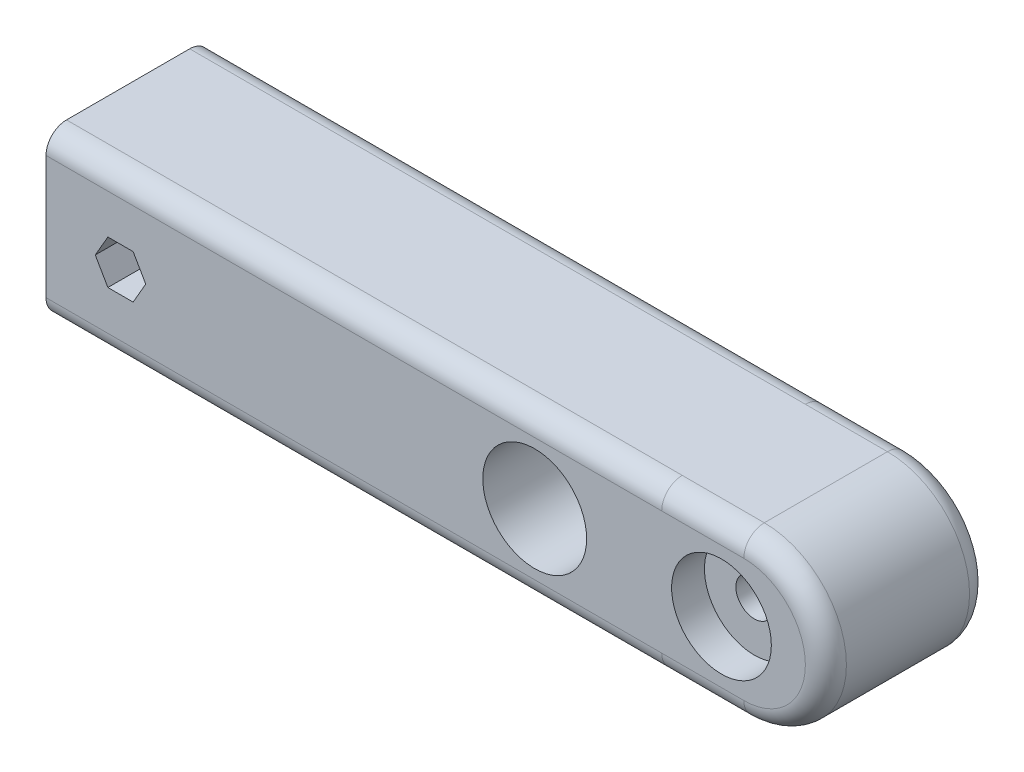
ISO-10303-21;
HEADER;
FILE_DESCRIPTION(('STEP AP214'),'2;1');
FILE_NAME('part.step','',(''),(''),'','','');
FILE_SCHEMA(('AUTOMOTIVE_DESIGN { 1 0 10303 214 1 1 1 1 }'));
ENDSEC;
DATA;
#1=APPLICATION_CONTEXT('core data for automotive mechanical design processes');
#2=APPLICATION_PROTOCOL_DEFINITION('international standard','automotive_design',2000,#1);
#3=PRODUCT_CONTEXT('',#1,'mechanical');
#4=PRODUCT('Part','Part','',(#3));
#5=PRODUCT_RELATED_PRODUCT_CATEGORY('part','',(#4));
#6=PRODUCT_DEFINITION_FORMATION('','',#4);
#7=PRODUCT_DEFINITION_CONTEXT('part definition',#1,'design');
#8=PRODUCT_DEFINITION('design','',#6,#7);
#9=PRODUCT_DEFINITION_SHAPE('','',#8);
#10=(LENGTH_UNIT() NAMED_UNIT(*) SI_UNIT(.MILLI.,.METRE.));
#11=(NAMED_UNIT(*) PLANE_ANGLE_UNIT() SI_UNIT($,.RADIAN.));
#12=(NAMED_UNIT(*) SI_UNIT($,.STERADIAN.) SOLID_ANGLE_UNIT());
#13=UNCERTAINTY_MEASURE_WITH_UNIT(LENGTH_MEASURE(1.E-05),#10,'distance_accuracy_value','');
#14=(GEOMETRIC_REPRESENTATION_CONTEXT(3) GLOBAL_UNCERTAINTY_ASSIGNED_CONTEXT((#13)) GLOBAL_UNIT_ASSIGNED_CONTEXT((#10,
#11,#12)) REPRESENTATION_CONTEXT('',''));
#15=CARTESIAN_POINT('',(0.,0.,0.));
#16=DIRECTION('',(0.,0.,1.));
#17=DIRECTION('',(1.,0.,0.));
#18=AXIS2_PLACEMENT_3D('',#15,#16,#17);
#19=CARTESIAN_POINT('',(21.225,14.6739437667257,86.));
#20=DIRECTION('',(0.,-1.,0.));
#21=DIRECTION('',(1.,0.,0.));
#22=AXIS2_PLACEMENT_3D('',#19,#20,#21);
#23=PLANE('',#22);
#24=DIRECTION('',(1.,0.,0.));
#25=VECTOR('',#24,1.);
#26=CARTESIAN_POINT('',(21.225,14.6739437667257,8.00000000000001));
#27=LINE('',#26,#25);
#28=CARTESIAN_POINT('',(15.075,14.6739437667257,8.00000000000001));
#29=VERTEX_POINT('',#28);
#30=CARTESIAN_POINT('',(21.225,14.6739437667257,8.00000000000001));
#31=VERTEX_POINT('',#30);
#32=EDGE_CURVE('E171',#29,#31,#27,.T.);
#33=ORIENTED_EDGE('',*,*,#32,.F.);
#34=DIRECTION('',(0.,0.,-1.));
#35=VECTOR('',#34,1.);
#36=CARTESIAN_POINT('',(15.075,14.6739437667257,86.));
#37=LINE('',#36,#35);
#38=CARTESIAN_POINT('',(15.075,14.6739437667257,40.));
#39=VERTEX_POINT('',#38);
#40=EDGE_CURVE('E179',#39,#29,#37,.T.);
#41=ORIENTED_EDGE('',*,*,#40,.F.);
#42=DIRECTION('',(-1.,0.,0.));
#43=VECTOR('',#42,1.);
#44=CARTESIAN_POINT('',(0.,14.6739437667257,40.));
#45=LINE('',#44,#43);
#46=CARTESIAN_POINT('',(21.225,14.6739437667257,40.));
#47=VERTEX_POINT('',#46);
#48=EDGE_CURVE('E221',#47,#39,#45,.T.);
#49=ORIENTED_EDGE('',*,*,#48,.F.);
#50=DIRECTION('',(0.,0.,-1.));
#51=VECTOR('',#50,1.);
#52=CARTESIAN_POINT('',(21.225,14.6739437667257,86.));
#53=LINE('',#52,#51);
#54=EDGE_CURVE('E182',#47,#31,#53,.T.);
#55=ORIENTED_EDGE('',*,*,#54,.T.);
#56=EDGE_LOOP('',(#33,#41,#49,#55));
#57=FACE_BOUND('',#56,.T.);
#58=ADVANCED_FACE('F47',(#57),#23,.F.);
#59=CARTESIAN_POINT('',(24.3,20.,86.));
#60=DIRECTION('',(0.866025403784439,-0.5,0.));
#61=DIRECTION('',(0.5,0.866025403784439,0.));
#62=AXIS2_PLACEMENT_3D('',#59,#60,#61);
#63=PLANE('',#62);
#64=DIRECTION('',(0.5,0.866025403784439,0.));
#65=VECTOR('',#64,1.);
#66=CARTESIAN_POINT('',(24.3,20.,8.00000000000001));
#67=LINE('',#66,#65);
#68=CARTESIAN_POINT('',(24.3,20.,8.00000000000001));
#69=VERTEX_POINT('',#68);
#70=EDGE_CURVE('E185',#31,#69,#67,.T.);
#71=ORIENTED_EDGE('',*,*,#70,.F.);
#72=ORIENTED_EDGE('',*,*,#54,.F.);
#73=DIRECTION('',(-0.5,-0.866025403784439,0.));
#74=VECTOR('',#73,1.);
#75=CARTESIAN_POINT('',(26.8852540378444,24.4777913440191,40.));
#76=LINE('',#75,#74);
#77=CARTESIAN_POINT('',(24.3,20.,40.));
#78=VERTEX_POINT('',#77);
#79=EDGE_CURVE('E217',#78,#47,#76,.T.);
#80=ORIENTED_EDGE('',*,*,#79,.F.);
#81=DIRECTION('',(0.,0.,-1.));
#82=VECTOR('',#81,1.);
#83=CARTESIAN_POINT('',(24.3,20.,86.));
#84=LINE('',#83,#82);
#85=EDGE_CURVE('E385',#78,#69,#84,.T.);
#86=ORIENTED_EDGE('',*,*,#85,.T.);
#87=EDGE_LOOP('',(#71,#72,#80,#86));
#88=FACE_BOUND('',#87,.T.);
#89=ADVANCED_FACE('F407',(#88),#63,.F.);
#90=CARTESIAN_POINT('',(21.225,25.3260562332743,86.));
#91=DIRECTION('',(0.866025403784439,0.5,0.));
#92=DIRECTION('',(-0.5,0.866025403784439,0.));
#93=AXIS2_PLACEMENT_3D('',#90,#91,#92);
#94=PLANE('',#93);
#95=DIRECTION('',(-0.5,0.866025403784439,0.));
#96=VECTOR('',#95,1.);
#97=CARTESIAN_POINT('',(21.225,25.3260562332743,8.00000000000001));
#98=LINE('',#97,#96);
#99=CARTESIAN_POINT('',(21.225,25.3260562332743,8.00000000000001));
#100=VERTEX_POINT('',#99);
#101=EDGE_CURVE('E411',#69,#100,#98,.T.);
#102=ORIENTED_EDGE('',*,*,#101,.F.);
#103=ORIENTED_EDGE('',*,*,#85,.F.);
#104=DIRECTION('',(0.5,-0.866025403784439,0.));
#105=VECTOR('',#104,1.);
#106=CARTESIAN_POINT('',(9.56474596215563,45.5222086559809,40.));
#107=LINE('',#106,#105);
#108=CARTESIAN_POINT('',(21.225,25.3260562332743,40.));
#109=VERTEX_POINT('',#108);
#110=EDGE_CURVE('E213',#109,#78,#107,.T.);
#111=ORIENTED_EDGE('',*,*,#110,.F.);
#112=DIRECTION('',(0.,0.,-1.));
#113=VECTOR('',#112,1.);
#114=CARTESIAN_POINT('',(21.225,25.3260562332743,86.));
#115=LINE('',#114,#113);
#116=EDGE_CURVE('E389',#109,#100,#115,.T.);
#117=ORIENTED_EDGE('',*,*,#116,.T.);
#118=EDGE_LOOP('',(#102,#103,#111,#117));
#119=FACE_BOUND('',#118,.T.);
#120=ADVANCED_FACE('F520',(#119),#94,.F.);
#121=CARTESIAN_POINT('',(15.075,25.3260562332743,86.));
#122=DIRECTION('',(0.,1.,0.));
#123=DIRECTION('',(0.,0.,1.));
#124=AXIS2_PLACEMENT_3D('',#121,#122,#123);
#125=PLANE('',#124);
#126=DIRECTION('',(-1.,0.,0.));
#127=VECTOR('',#126,1.);
#128=CARTESIAN_POINT('',(15.075,25.3260562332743,8.00000000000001));
#129=LINE('',#128,#127);
#130=CARTESIAN_POINT('',(15.075,25.3260562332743,8.00000000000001));
#131=VERTEX_POINT('',#130);
#132=EDGE_CURVE('E399',#100,#131,#129,.T.);
#133=ORIENTED_EDGE('',*,*,#132,.F.);
#134=ORIENTED_EDGE('',*,*,#116,.F.);
#135=DIRECTION('',(1.,0.,0.));
#136=VECTOR('',#135,1.);
#137=CARTESIAN_POINT('',(0.,25.3260562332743,40.));
#138=LINE('',#137,#136);
#139=CARTESIAN_POINT('',(15.075,25.3260562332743,40.));
#140=VERTEX_POINT('',#139);
#141=EDGE_CURVE('E209',#140,#109,#138,.T.);
#142=ORIENTED_EDGE('',*,*,#141,.F.);
#143=DIRECTION('',(0.,0.,-1.));
#144=VECTOR('',#143,1.);
#145=CARTESIAN_POINT('',(15.075,25.3260562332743,86.));
#146=LINE('',#145,#144);
#147=EDGE_CURVE('E196',#140,#131,#146,.T.);
#148=ORIENTED_EDGE('',*,*,#147,.T.);
#149=EDGE_LOOP('',(#133,#134,#142,#148));
#150=FACE_BOUND('',#149,.T.);
#151=ADVANCED_FACE('F397',(#150),#125,.F.);
#152=CARTESIAN_POINT('',(12.,20.,86.));
#153=DIRECTION('',(-0.866025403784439,0.5,0.));
#154=DIRECTION('',(-0.5,-0.866025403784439,0.));
#155=AXIS2_PLACEMENT_3D('',#152,#153,#154);
#156=PLANE('',#155);
#157=DIRECTION('',(-0.5,-0.866025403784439,0.));
#158=VECTOR('',#157,1.);
#159=CARTESIAN_POINT('',(12.,20.,8.00000000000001));
#160=LINE('',#159,#158);
#161=CARTESIAN_POINT('',(12.,20.,8.00000000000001));
#162=VERTEX_POINT('',#161);
#163=EDGE_CURVE('E62',#131,#162,#160,.T.);
#164=ORIENTED_EDGE('',*,*,#163,.F.);
#165=ORIENTED_EDGE('',*,*,#147,.F.);
#166=DIRECTION('',(0.5,0.866025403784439,0.));
#167=VECTOR('',#166,1.);
#168=CARTESIAN_POINT('',(17.6602540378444,29.8038475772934,40.));
#169=LINE('',#168,#167);
#170=CARTESIAN_POINT('',(12.,20.,40.));
#171=VERTEX_POINT('',#170);
#172=EDGE_CURVE('E205',#171,#140,#169,.T.);
#173=ORIENTED_EDGE('',*,*,#172,.F.);
#174=DIRECTION('',(0.,0.,-1.));
#175=VECTOR('',#174,1.);
#176=CARTESIAN_POINT('',(12.,20.,86.));
#177=LINE('',#176,#175);
#178=EDGE_CURVE('E191',#171,#162,#177,.T.);
#179=ORIENTED_EDGE('',*,*,#178,.T.);
#180=EDGE_LOOP('',(#164,#165,#173,#179));
#181=FACE_BOUND('',#180,.T.);
#182=ADVANCED_FACE('F402',(#181),#156,.F.);
#183=CARTESIAN_POINT('',(15.075,14.6739437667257,86.));
#184=DIRECTION('',(-0.866025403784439,-0.5,0.));
#185=DIRECTION('',(0.5,-0.866025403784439,0.));
#186=AXIS2_PLACEMENT_3D('',#183,#184,#185);
#187=PLANE('',#186);
#188=DIRECTION('',(0.5,-0.866025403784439,0.));
#189=VECTOR('',#188,1.);
#190=CARTESIAN_POINT('',(15.075,14.6739437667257,8.00000000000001));
#191=LINE('',#190,#189);
#192=EDGE_CURVE('E11',#162,#29,#191,.T.);
#193=ORIENTED_EDGE('',*,*,#192,.F.);
#194=ORIENTED_EDGE('',*,*,#178,.F.);
#195=DIRECTION('',(-0.5,0.866025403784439,0.));
#196=VECTOR('',#195,1.);
#197=CARTESIAN_POINT('',(0.33974596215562,40.1961524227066,40.));
#198=LINE('',#197,#196);
#199=EDGE_CURVE('E189',#39,#171,#198,.T.);
#200=ORIENTED_EDGE('',*,*,#199,.F.);
#201=ORIENTED_EDGE('',*,*,#40,.T.);
#202=EDGE_LOOP('',(#193,#194,#200,#201));
#203=FACE_BOUND('',#202,.T.);
#204=ADVANCED_FACE('F187',(#203),#187,.F.);
#205=CARTESIAN_POINT('',(164.56347457,20.,-20.));
#206=DIRECTION('',(0.,0.,1.));
#207=DIRECTION('',(1.,0.,0.));
#208=AXIS2_PLACEMENT_3D('',#205,#206,#207);
#209=CYLINDRICAL_SURFACE('',#208,4.49999999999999);
#210=CARTESIAN_POINT('',(164.56347457,20.,32.));
#211=DIRECTION('',(0.,0.,1.));
#212=DIRECTION('',(1.,0.,0.));
#213=AXIS2_PLACEMENT_3D('',#210,#211,#212);
#214=CIRCLE('',#213,4.49999999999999);
#215=CARTESIAN_POINT('',(169.06347457,20.,32.));
#216=VERTEX_POINT('',#215);
#217=EDGE_CURVE('E343',#216,#216,#214,.F.);
#218=ORIENTED_EDGE('',*,*,#217,.F.);
#219=EDGE_LOOP('',(#218));
#220=FACE_BOUND('',#219,.T.);
#221=CARTESIAN_POINT('',(164.56347457,20.,8.));
#222=DIRECTION('',(0.,0.,-1.));
#223=DIRECTION('',(-1.,0.,0.));
#224=AXIS2_PLACEMENT_3D('',#221,#222,#223);
#225=CIRCLE('',#224,4.49999999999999);
#226=CARTESIAN_POINT('',(160.06347457,20.,8.));
#227=VERTEX_POINT('',#226);
#228=EDGE_CURVE('E350',#227,#227,#225,.F.);
#229=ORIENTED_EDGE('',*,*,#228,.F.);
#230=EDGE_LOOP('',(#229));
#231=FACE_BOUND('',#230,.T.);
#232=ADVANCED_FACE('F534',(#220,#231),#209,.F.);
#233=CARTESIAN_POINT('',(0.,40.,0.));
#234=DIRECTION('',(1.,0.,0.));
#235=DIRECTION('',(0.,0.,-1.));
#236=AXIS2_PLACEMENT_3D('',#233,#234,#235);
#237=PLANE('',#236);
#238=DIRECTION('',(0.,0.,1.));
#239=VECTOR('',#238,1.);
#240=CARTESIAN_POINT('',(0.,40.,0.));
#241=LINE('',#240,#239);
#242=CARTESIAN_POINT('',(0.,40.,5.));
#243=VERTEX_POINT('',#242);
#244=CARTESIAN_POINT('',(0.,40.,35.));
#245=VERTEX_POINT('',#244);
#246=EDGE_CURVE('E225',#243,#245,#241,.T.);
#247=ORIENTED_EDGE('',*,*,#246,.F.);
#248=CARTESIAN_POINT('',(0.,35.,5.));
#249=DIRECTION('',(1.,0.,0.));
#250=DIRECTION('',(0.,0.,-1.));
#251=AXIS2_PLACEMENT_3D('',#248,#249,#250);
#252=CIRCLE('',#251,5.);
#253=CARTESIAN_POINT('',(0.,35.,0.));
#254=VERTEX_POINT('',#253);
#255=EDGE_CURVE('E267',#243,#254,#252,.F.);
#256=ORIENTED_EDGE('',*,*,#255,.T.);
#257=DIRECTION('',(0.,-1.,0.));
#258=VECTOR('',#257,1.);
#259=CARTESIAN_POINT('',(0.,40.,0.));
#260=LINE('',#259,#258);
#261=CARTESIAN_POINT('',(0.,5.,0.));
#262=VERTEX_POINT('',#261);
#263=EDGE_CURVE('E229',#254,#262,#260,.T.);
#264=ORIENTED_EDGE('',*,*,#263,.T.);
#265=CARTESIAN_POINT('',(0.,5.,5.));
#266=DIRECTION('',(1.,0.,0.));
#267=DIRECTION('',(0.,0.,-1.));
#268=AXIS2_PLACEMENT_3D('',#265,#266,#267);
#269=CIRCLE('',#268,5.);
#270=CARTESIAN_POINT('',(0.,0.,5.));
#271=VERTEX_POINT('',#270);
#272=EDGE_CURVE('E243',#262,#271,#269,.F.);
#273=ORIENTED_EDGE('',*,*,#272,.T.);
#274=DIRECTION('',(0.,0.,1.));
#275=VECTOR('',#274,1.);
#276=CARTESIAN_POINT('',(0.,0.,0.));
#277=LINE('',#276,#275);
#278=CARTESIAN_POINT('',(0.,0.,35.));
#279=VERTEX_POINT('',#278);
#280=EDGE_CURVE('E224',#271,#279,#277,.T.);
#281=ORIENTED_EDGE('',*,*,#280,.T.);
#282=CARTESIAN_POINT('',(0.,5.,35.));
#283=DIRECTION('',(1.,0.,0.));
#284=DIRECTION('',(0.,0.,-1.));
#285=AXIS2_PLACEMENT_3D('',#282,#283,#284);
#286=CIRCLE('',#285,5.);
#287=CARTESIAN_POINT('',(0.,5.,40.));
#288=VERTEX_POINT('',#287);
#289=EDGE_CURVE('E261',#279,#288,#286,.F.);
#290=ORIENTED_EDGE('',*,*,#289,.T.);
#291=DIRECTION('',(0.,-1.,0.));
#292=VECTOR('',#291,1.);
#293=CARTESIAN_POINT('',(0.,40.,40.));
#294=LINE('',#293,#292);
#295=CARTESIAN_POINT('',(0.,35.,40.));
#296=VERTEX_POINT('',#295);
#297=EDGE_CURVE('E235',#296,#288,#294,.T.);
#298=ORIENTED_EDGE('',*,*,#297,.F.);
#299=CARTESIAN_POINT('',(0.,35.,35.));
#300=DIRECTION('',(1.,0.,0.));
#301=DIRECTION('',(0.,0.,-1.));
#302=AXIS2_PLACEMENT_3D('',#299,#300,#301);
#303=CIRCLE('',#302,5.);
#304=EDGE_CURVE('E264',#296,#245,#303,.F.);
#305=ORIENTED_EDGE('',*,*,#304,.T.);
#306=EDGE_LOOP('',(#247,#256,#264,#273,#281,#290,#298,#305));
#307=FACE_BOUND('',#306,.T.);
#308=ADVANCED_FACE('F469',(#307),#237,.F.);
#309=CARTESIAN_POINT('',(0.,40.,40.));
#310=DIRECTION('',(0.,0.,-1.));
#311=DIRECTION('',(-1.,0.,0.));
#312=AXIS2_PLACEMENT_3D('',#309,#310,#311);
#313=PLANE('',#312);
#314=CARTESIAN_POINT('',(164.56347457,20.,40.));
#315=DIRECTION('',(0.,0.,1.));
#316=DIRECTION('',(1.,0.,0.));
#317=AXIS2_PLACEMENT_3D('',#314,#315,#316);
#318=CIRCLE('',#317,12.15);
#319=CARTESIAN_POINT('',(176.71347457,20.,40.));
#320=VERTEX_POINT('',#319);
#321=EDGE_CURVE('E353',#320,#320,#318,.T.);
#322=ORIENTED_EDGE('',*,*,#321,.F.);
#323=EDGE_LOOP('',(#322));
#324=FACE_BOUND('',#323,.T.);
#325=CARTESIAN_POINT('',(119.05843723,20.,40.));
#326=DIRECTION('',(0.,0.,1.));
#327=DIRECTION('',(1.,0.,0.));
#328=AXIS2_PLACEMENT_3D('',#325,#326,#327);
#329=CIRCLE('',#328,12.65);
#330=CARTESIAN_POINT('',(131.70843723,20.,40.));
#331=VERTEX_POINT('',#330);
#332=EDGE_CURVE('E199',#331,#331,#329,.T.);
#333=ORIENTED_EDGE('',*,*,#332,.F.);
#334=EDGE_LOOP('',(#333));
#335=FACE_BOUND('',#334,.T.);
#336=ORIENTED_EDGE('',*,*,#79,.T.);
#337=ORIENTED_EDGE('',*,*,#48,.T.);
#338=ORIENTED_EDGE('',*,*,#199,.T.);
#339=ORIENTED_EDGE('',*,*,#172,.T.);
#340=ORIENTED_EDGE('',*,*,#141,.T.);
#341=ORIENTED_EDGE('',*,*,#110,.T.);
#342=EDGE_LOOP('',(#336,#337,#338,#339,#340,#341));
#343=FACE_BOUND('',#342,.T.);
#344=CARTESIAN_POINT('',(170.,20.,40.));
#345=DIRECTION('',(0.,0.,-1.));
#346=DIRECTION('',(-1.,0.,0.));
#347=AXIS2_PLACEMENT_3D('',#344,#345,#346);
#348=CIRCLE('',#347,15.);
#349=CARTESIAN_POINT('',(170.,5.,40.));
#350=VERTEX_POINT('',#349);
#351=CARTESIAN_POINT('',(170.,35.,40.));
#352=VERTEX_POINT('',#351);
#353=EDGE_CURVE('E296',#350,#352,#348,.F.);
#354=ORIENTED_EDGE('',*,*,#353,.T.);
#355=DIRECTION('',(-1.,0.,0.));
#356=VECTOR('',#355,1.);
#357=CARTESIAN_POINT('',(150.,35.,40.));
#358=LINE('',#357,#356);
#359=CARTESIAN_POINT('',(150.,35.,40.));
#360=VERTEX_POINT('',#359);
#361=EDGE_CURVE('E299',#352,#360,#358,.T.);
#362=ORIENTED_EDGE('',*,*,#361,.T.);
#363=DIRECTION('',(1.,0.,0.));
#364=VECTOR('',#363,1.);
#365=CARTESIAN_POINT('',(0.,35.,40.));
#366=LINE('',#365,#364);
#367=EDGE_CURVE('E287',#360,#296,#366,.F.);
#368=ORIENTED_EDGE('',*,*,#367,.T.);
#369=ORIENTED_EDGE('',*,*,#297,.T.);
#370=DIRECTION('',(1.,0.,0.));
#371=VECTOR('',#370,1.);
#372=CARTESIAN_POINT('',(0.,5.,40.));
#373=LINE('',#372,#371);
#374=CARTESIAN_POINT('',(150.,5.,40.));
#375=VERTEX_POINT('',#374);
#376=EDGE_CURVE('E283',#288,#375,#373,.T.);
#377=ORIENTED_EDGE('',*,*,#376,.T.);
#378=DIRECTION('',(1.,0.,0.));
#379=VECTOR('',#378,1.);
#380=CARTESIAN_POINT('',(0.,5.,40.));
#381=LINE('',#380,#379);
#382=EDGE_CURVE('E292',#375,#350,#381,.T.);
#383=ORIENTED_EDGE('',*,*,#382,.T.);
#384=EDGE_LOOP('',(#354,#362,#368,#369,#377,#383));
#385=FACE_BOUND('',#384,.T.);
#386=ADVANCED_FACE('F404',(#324,#335,#343,#385),#313,.F.);
#387=CARTESIAN_POINT('',(0.,40.,0.));
#388=DIRECTION('',(0.,0.,1.));
#389=DIRECTION('',(1.,0.,0.));
#390=AXIS2_PLACEMENT_3D('',#387,#388,#389);
#391=PLANE('',#390);
#392=CARTESIAN_POINT('',(18.2099336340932,19.9407689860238,0.));
#393=DIRECTION('',(0.,0.,-1.));
#394=DIRECTION('',(-1.,0.,0.));
#395=AXIS2_PLACEMENT_3D('',#392,#393,#394);
#396=CIRCLE('',#395,12.15);
#397=CARTESIAN_POINT('',(6.05993363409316,19.9407689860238,0.));
#398=VERTEX_POINT('',#397);
#399=EDGE_CURVE('E420',#398,#398,#396,.T.);
#400=ORIENTED_EDGE('',*,*,#399,.F.);
#401=EDGE_LOOP('',(#400));
#402=FACE_BOUND('',#401,.T.);
#403=CARTESIAN_POINT('',(164.56347457,20.,0.));
#404=DIRECTION('',(0.,0.,-1.));
#405=DIRECTION('',(-1.,0.,0.));
#406=AXIS2_PLACEMENT_3D('',#403,#404,#405);
#407=CIRCLE('',#406,12.15);
#408=CARTESIAN_POINT('',(152.41347457,20.,0.));
#409=VERTEX_POINT('',#408);
#410=EDGE_CURVE('E184',#409,#409,#407,.T.);
#411=ORIENTED_EDGE('',*,*,#410,.F.);
#412=EDGE_LOOP('',(#411));
#413=FACE_BOUND('',#412,.T.);
#414=CARTESIAN_POINT('',(119.05843723,20.,0.));
#415=DIRECTION('',(0.,0.,1.));
#416=DIRECTION('',(1.,0.,0.));
#417=AXIS2_PLACEMENT_3D('',#414,#415,#416);
#418=CIRCLE('',#417,12.65);
#419=CARTESIAN_POINT('',(131.70843723,20.,0.));
#420=VERTEX_POINT('',#419);
#421=EDGE_CURVE('E192',#420,#420,#418,.T.);
#422=ORIENTED_EDGE('',*,*,#421,.T.);
#423=EDGE_LOOP('',(#422));
#424=FACE_BOUND('',#423,.T.);
#425=DIRECTION('',(-1.,0.,0.));
#426=VECTOR('',#425,1.);
#427=CARTESIAN_POINT('',(150.,35.,0.));
#428=LINE('',#427,#426);
#429=CARTESIAN_POINT('',(150.,35.,0.));
#430=VERTEX_POINT('',#429);
#431=EDGE_CURVE('E270',#254,#430,#428,.F.);
#432=ORIENTED_EDGE('',*,*,#431,.T.);
#433=DIRECTION('',(-1.,0.,0.));
#434=VECTOR('',#433,1.);
#435=CARTESIAN_POINT('',(170.,35.,0.));
#436=LINE('',#435,#434);
#437=CARTESIAN_POINT('',(170.,35.,0.));
#438=VERTEX_POINT('',#437);
#439=EDGE_CURVE('E70',#430,#438,#436,.F.);
#440=ORIENTED_EDGE('',*,*,#439,.T.);
#441=CARTESIAN_POINT('',(170.,20.,0.));
#442=DIRECTION('',(0.,0.,1.));
#443=DIRECTION('',(1.,0.,0.));
#444=AXIS2_PLACEMENT_3D('',#441,#442,#443);
#445=CIRCLE('',#444,15.);
#446=CARTESIAN_POINT('',(170.,5.,0.));
#447=VERTEX_POINT('',#446);
#448=EDGE_CURVE('E319',#438,#447,#445,.F.);
#449=ORIENTED_EDGE('',*,*,#448,.T.);
#450=DIRECTION('',(1.,0.,0.));
#451=VECTOR('',#450,1.);
#452=CARTESIAN_POINT('',(0.,5.,0.));
#453=LINE('',#452,#451);
#454=CARTESIAN_POINT('',(150.,5.,0.));
#455=VERTEX_POINT('',#454);
#456=EDGE_CURVE('E316',#447,#455,#453,.F.);
#457=ORIENTED_EDGE('',*,*,#456,.T.);
#458=DIRECTION('',(-1.,0.,0.));
#459=VECTOR('',#458,1.);
#460=CARTESIAN_POINT('',(0.,5.,0.));
#461=LINE('',#460,#459);
#462=EDGE_CURVE('E239',#455,#262,#461,.T.);
#463=ORIENTED_EDGE('',*,*,#462,.T.);
#464=ORIENTED_EDGE('',*,*,#263,.F.);
#465=EDGE_LOOP('',(#432,#440,#449,#457,#463,#464));
#466=FACE_BOUND('',#465,.T.);
#467=ADVANCED_FACE('F435',(#402,#413,#424,#466),#391,.F.);
#468=CARTESIAN_POINT('',(0.,40.,0.));
#469=DIRECTION('',(0.,1.,0.));
#470=DIRECTION('',(0.,0.,1.));
#471=AXIS2_PLACEMENT_3D('',#468,#469,#470);
#472=PLANE('',#471);
#473=DIRECTION('',(1.,0.,0.));
#474=VECTOR('',#473,1.);
#475=CARTESIAN_POINT('',(150.,40.,35.));
#476=LINE('',#475,#474);
#477=CARTESIAN_POINT('',(150.,40.,35.));
#478=VERTEX_POINT('',#477);
#479=EDGE_CURVE('E253',#245,#478,#476,.T.);
#480=ORIENTED_EDGE('',*,*,#479,.T.);
#481=DIRECTION('',(-1.,0.,0.));
#482=VECTOR('',#481,1.);
#483=CARTESIAN_POINT('',(170.,40.,35.));
#484=LINE('',#483,#482);
#485=CARTESIAN_POINT('',(170.,40.,35.));
#486=VERTEX_POINT('',#485);
#487=EDGE_CURVE('E307',#478,#486,#484,.F.);
#488=ORIENTED_EDGE('',*,*,#487,.T.);
#489=DIRECTION('',(0.,0.,1.));
#490=VECTOR('',#489,1.);
#491=CARTESIAN_POINT('',(170.,40.,0.));
#492=LINE('',#491,#490);
#493=CARTESIAN_POINT('',(170.,40.,5.));
#494=VERTEX_POINT('',#493);
#495=EDGE_CURVE('E373',#494,#486,#492,.T.);
#496=ORIENTED_EDGE('',*,*,#495,.F.);
#497=DIRECTION('',(-1.,0.,0.));
#498=VECTOR('',#497,1.);
#499=CARTESIAN_POINT('',(150.,40.,5.));
#500=LINE('',#499,#498);
#501=CARTESIAN_POINT('',(150.,40.,5.));
#502=VERTEX_POINT('',#501);
#503=EDGE_CURVE('E303',#494,#502,#500,.T.);
#504=ORIENTED_EDGE('',*,*,#503,.T.);
#505=DIRECTION('',(-1.,0.,0.));
#506=VECTOR('',#505,1.);
#507=CARTESIAN_POINT('',(0.,40.,5.));
#508=LINE('',#507,#506);
#509=EDGE_CURVE('E257',#502,#243,#508,.T.);
#510=ORIENTED_EDGE('',*,*,#509,.T.);
#511=ORIENTED_EDGE('',*,*,#246,.T.);
#512=EDGE_LOOP('',(#480,#488,#496,#504,#510,#511));
#513=FACE_BOUND('',#512,.T.);
#514=ADVANCED_FACE('F438',(#513),#472,.T.);
#515=CARTESIAN_POINT('',(0.,0.,0.));
#516=DIRECTION('',(0.,1.,0.));
#517=DIRECTION('',(0.,0.,1.));
#518=AXIS2_PLACEMENT_3D('',#515,#516,#517);
#519=PLANE('',#518);
#520=DIRECTION('',(0.,0.,1.));
#521=VECTOR('',#520,1.);
#522=CARTESIAN_POINT('',(170.,0.,0.));
#523=LINE('',#522,#521);
#524=CARTESIAN_POINT('',(170.,0.,5.));
#525=VERTEX_POINT('',#524);
#526=CARTESIAN_POINT('',(170.,0.,35.));
#527=VERTEX_POINT('',#526);
#528=EDGE_CURVE('E338',#525,#527,#523,.T.);
#529=ORIENTED_EDGE('',*,*,#528,.T.);
#530=DIRECTION('',(1.,0.,0.));
#531=VECTOR('',#530,1.);
#532=CARTESIAN_POINT('',(0.,0.,35.));
#533=LINE('',#532,#531);
#534=CARTESIAN_POINT('',(150.,0.,35.));
#535=VERTEX_POINT('',#534);
#536=EDGE_CURVE('E56',#527,#535,#533,.F.);
#537=ORIENTED_EDGE('',*,*,#536,.T.);
#538=DIRECTION('',(1.,0.,0.));
#539=VECTOR('',#538,1.);
#540=CARTESIAN_POINT('',(0.,0.,35.));
#541=LINE('',#540,#539);
#542=EDGE_CURVE('E290',#535,#279,#541,.F.);
#543=ORIENTED_EDGE('',*,*,#542,.T.);
#544=ORIENTED_EDGE('',*,*,#280,.F.);
#545=DIRECTION('',(-1.,0.,0.));
#546=VECTOR('',#545,1.);
#547=CARTESIAN_POINT('',(0.,0.,5.));
#548=LINE('',#547,#546);
#549=CARTESIAN_POINT('',(150.,0.,5.));
#550=VERTEX_POINT('',#549);
#551=EDGE_CURVE('E246',#271,#550,#548,.F.);
#552=ORIENTED_EDGE('',*,*,#551,.T.);
#553=DIRECTION('',(1.,0.,0.));
#554=VECTOR('',#553,1.);
#555=CARTESIAN_POINT('',(0.,0.,5.));
#556=LINE('',#555,#554);
#557=EDGE_CURVE('E324',#550,#525,#556,.T.);
#558=ORIENTED_EDGE('',*,*,#557,.T.);
#559=EDGE_LOOP('',(#529,#537,#543,#544,#552,#558));
#560=FACE_BOUND('',#559,.T.);
#561=ADVANCED_FACE('F472',(#560),#519,.F.);
#562=CARTESIAN_POINT('',(0.,5.,5.));
#563=DIRECTION('',(-1.,0.,0.));
#564=DIRECTION('',(0.,0.,1.));
#565=AXIS2_PLACEMENT_3D('',#562,#563,#564);
#566=CYLINDRICAL_SURFACE('',#565,5.);
#567=CARTESIAN_POINT('',(150.,5.,5.));
#568=DIRECTION('',(-1.,0.,0.));
#569=DIRECTION('',(0.,0.,1.));
#570=AXIS2_PLACEMENT_3D('',#567,#568,#569);
#571=CIRCLE('',#570,5.);
#572=EDGE_CURVE('E249',#550,#455,#571,.F.);
#573=ORIENTED_EDGE('',*,*,#572,.F.);
#574=ORIENTED_EDGE('',*,*,#551,.F.);
#575=ORIENTED_EDGE('',*,*,#272,.F.);
#576=ORIENTED_EDGE('',*,*,#462,.F.);
#577=EDGE_LOOP('',(#573,#574,#575,#576));
#578=FACE_BOUND('',#577,.T.);
#579=ADVANCED_FACE('F464',(#578),#566,.T.);
#580=CARTESIAN_POINT('',(0.,35.,5.));
#581=DIRECTION('',(1.,0.,0.));
#582=DIRECTION('',(0.,0.,-1.));
#583=AXIS2_PLACEMENT_3D('',#580,#581,#582);
#584=CYLINDRICAL_SURFACE('',#583,5.);
#585=CARTESIAN_POINT('',(150.,35.,5.));
#586=DIRECTION('',(-1.,0.,0.));
#587=DIRECTION('',(0.,0.,1.));
#588=AXIS2_PLACEMENT_3D('',#585,#586,#587);
#589=CIRCLE('',#588,5.);
#590=EDGE_CURVE('E280',#430,#502,#589,.F.);
#591=ORIENTED_EDGE('',*,*,#590,.F.);
#592=ORIENTED_EDGE('',*,*,#431,.F.);
#593=ORIENTED_EDGE('',*,*,#255,.F.);
#594=ORIENTED_EDGE('',*,*,#509,.F.);
#595=EDGE_LOOP('',(#591,#592,#593,#594));
#596=FACE_BOUND('',#595,.T.);
#597=ADVANCED_FACE('F448',(#596),#584,.T.);
#598=CARTESIAN_POINT('',(0.,35.,35.));
#599=DIRECTION('',(-1.,0.,0.));
#600=DIRECTION('',(0.,0.,1.));
#601=AXIS2_PLACEMENT_3D('',#598,#599,#600);
#602=CYLINDRICAL_SURFACE('',#601,5.);
#603=ORIENTED_EDGE('',*,*,#304,.F.);
#604=ORIENTED_EDGE('',*,*,#367,.F.);
#605=CARTESIAN_POINT('',(150.,35.,35.));
#606=DIRECTION('',(-1.,0.,0.));
#607=DIRECTION('',(0.,0.,1.));
#608=AXIS2_PLACEMENT_3D('',#605,#606,#607);
#609=CIRCLE('',#608,5.);
#610=EDGE_CURVE('E277',#478,#360,#609,.F.);
#611=ORIENTED_EDGE('',*,*,#610,.F.);
#612=ORIENTED_EDGE('',*,*,#479,.F.);
#613=EDGE_LOOP('',(#603,#604,#611,#612));
#614=FACE_BOUND('',#613,.T.);
#615=ADVANCED_FACE('F489',(#614),#602,.T.);
#616=CARTESIAN_POINT('',(0.,5.,35.));
#617=DIRECTION('',(1.,0.,0.));
#618=DIRECTION('',(0.,0.,-1.));
#619=AXIS2_PLACEMENT_3D('',#616,#617,#618);
#620=CYLINDRICAL_SURFACE('',#619,5.);
#621=ORIENTED_EDGE('',*,*,#289,.F.);
#622=ORIENTED_EDGE('',*,*,#542,.F.);
#623=CARTESIAN_POINT('',(150.,5.,35.));
#624=DIRECTION('',(-1.,0.,0.));
#625=DIRECTION('',(0.,0.,1.));
#626=AXIS2_PLACEMENT_3D('',#623,#624,#625);
#627=CIRCLE('',#626,5.);
#628=EDGE_CURVE('E273',#375,#535,#627,.F.);
#629=ORIENTED_EDGE('',*,*,#628,.F.);
#630=ORIENTED_EDGE('',*,*,#376,.F.);
#631=EDGE_LOOP('',(#621,#622,#629,#630));
#632=FACE_BOUND('',#631,.T.);
#633=ADVANCED_FACE('F476',(#632),#620,.T.);
#634=CARTESIAN_POINT('',(119.05843723,20.,-32.));
#635=DIRECTION('',(0.,0.,1.));
#636=DIRECTION('',(1.,0.,0.));
#637=AXIS2_PLACEMENT_3D('',#634,#635,#636);
#638=CYLINDRICAL_SURFACE('',#637,12.65);
#639=ORIENTED_EDGE('',*,*,#332,.T.);
#640=EDGE_LOOP('',(#639));
#641=FACE_BOUND('',#640,.T.);
#642=ORIENTED_EDGE('',*,*,#421,.F.);
#643=EDGE_LOOP('',(#642));
#644=FACE_BOUND('',#643,.T.);
#645=ADVANCED_FACE('F503',(#641,#644),#638,.F.);
#646=CARTESIAN_POINT('',(170.,20.,0.));
#647=DIRECTION('',(0.,0.,1.));
#648=DIRECTION('',(1.,0.,0.));
#649=AXIS2_PLACEMENT_3D('',#646,#647,#648);
#650=CYLINDRICAL_SURFACE('',#649,20.);
#651=ORIENTED_EDGE('',*,*,#495,.T.);
#652=CARTESIAN_POINT('',(170.,20.,35.));
#653=DIRECTION('',(0.,0.,-1.));
#654=DIRECTION('',(-1.,0.,0.));
#655=AXIS2_PLACEMENT_3D('',#652,#653,#654);
#656=CIRCLE('',#655,20.);
#657=EDGE_CURVE('E313',#486,#527,#656,.T.);
#658=ORIENTED_EDGE('',*,*,#657,.T.);
#659=ORIENTED_EDGE('',*,*,#528,.F.);
#660=CARTESIAN_POINT('',(170.,20.,5.));
#661=DIRECTION('',(0.,0.,1.));
#662=DIRECTION('',(1.,0.,0.));
#663=AXIS2_PLACEMENT_3D('',#660,#661,#662);
#664=CIRCLE('',#663,20.);
#665=EDGE_CURVE('E310',#525,#494,#664,.T.);
#666=ORIENTED_EDGE('',*,*,#665,.T.);
#667=EDGE_LOOP('',(#651,#658,#659,#666));
#668=FACE_BOUND('',#667,.T.);
#669=ADVANCED_FACE('F501',(#668),#650,.T.);
#670=CARTESIAN_POINT('',(0.,5.,35.));
#671=DIRECTION('',(1.,0.,0.));
#672=DIRECTION('',(0.,0.,-1.));
#673=AXIS2_PLACEMENT_3D('',#670,#671,#672);
#674=CYLINDRICAL_SURFACE('',#673,5.);
#675=ORIENTED_EDGE('',*,*,#628,.T.);
#676=ORIENTED_EDGE('',*,*,#536,.F.);
#677=CARTESIAN_POINT('',(170.,5.,35.));
#678=DIRECTION('',(1.,0.,0.));
#679=DIRECTION('',(0.,0.,-1.));
#680=AXIS2_PLACEMENT_3D('',#677,#678,#679);
#681=CIRCLE('',#680,5.);
#682=EDGE_CURVE('E333',#350,#527,#681,.T.);
#683=ORIENTED_EDGE('',*,*,#682,.F.);
#684=ORIENTED_EDGE('',*,*,#382,.F.);
#685=EDGE_LOOP('',(#675,#676,#683,#684));
#686=FACE_BOUND('',#685,.T.);
#687=ADVANCED_FACE('F480',(#686),#674,.T.);
#688=CARTESIAN_POINT('',(170.,20.,35.));
#689=DIRECTION('',(0.,0.,-1.));
#690=DIRECTION('',(-1.,0.,0.));
#691=AXIS2_PLACEMENT_3D('',#688,#689,#690);
#692=TOROIDAL_SURFACE('',#691,15.,5.);
#693=ORIENTED_EDGE('',*,*,#682,.T.);
#694=ORIENTED_EDGE('',*,*,#657,.F.);
#695=CARTESIAN_POINT('',(170.,35.,35.));
#696=DIRECTION('',(-1.,0.,0.));
#697=DIRECTION('',(0.,0.,1.));
#698=AXIS2_PLACEMENT_3D('',#695,#696,#697);
#699=CIRCLE('',#698,5.);
#700=EDGE_CURVE('E329',#352,#486,#699,.T.);
#701=ORIENTED_EDGE('',*,*,#700,.F.);
#702=ORIENTED_EDGE('',*,*,#353,.F.);
#703=EDGE_LOOP('',(#693,#694,#701,#702));
#704=FACE_BOUND('',#703,.T.);
#705=ADVANCED_FACE('F498',(#704),#692,.T.);
#706=CARTESIAN_POINT('',(0.,35.,35.));
#707=DIRECTION('',(1.,0.,0.));
#708=DIRECTION('',(0.,0.,-1.));
#709=AXIS2_PLACEMENT_3D('',#706,#707,#708);
#710=CYLINDRICAL_SURFACE('',#709,5.);
#711=ORIENTED_EDGE('',*,*,#700,.T.);
#712=ORIENTED_EDGE('',*,*,#487,.F.);
#713=ORIENTED_EDGE('',*,*,#610,.T.);
#714=ORIENTED_EDGE('',*,*,#361,.F.);
#715=EDGE_LOOP('',(#711,#712,#713,#714));
#716=FACE_BOUND('',#715,.T.);
#717=ADVANCED_FACE('F494',(#716),#710,.T.);
#718=CARTESIAN_POINT('',(0.,5.,5.));
#719=DIRECTION('',(1.,0.,0.));
#720=DIRECTION('',(0.,0.,-1.));
#721=AXIS2_PLACEMENT_3D('',#718,#719,#720);
#722=CYLINDRICAL_SURFACE('',#721,5.);
#723=ORIENTED_EDGE('',*,*,#572,.T.);
#724=ORIENTED_EDGE('',*,*,#456,.F.);
#725=CARTESIAN_POINT('',(170.,5.,5.));
#726=DIRECTION('',(1.,0.,0.));
#727=DIRECTION('',(0.,0.,-1.));
#728=AXIS2_PLACEMENT_3D('',#725,#726,#727);
#729=CIRCLE('',#728,5.);
#730=EDGE_CURVE('E334',#525,#447,#729,.T.);
#731=ORIENTED_EDGE('',*,*,#730,.F.);
#732=ORIENTED_EDGE('',*,*,#557,.F.);
#733=EDGE_LOOP('',(#723,#724,#731,#732));
#734=FACE_BOUND('',#733,.T.);
#735=ADVANCED_FACE('F49',(#734),#722,.T.);
#736=CARTESIAN_POINT('',(170.,20.,5.));
#737=DIRECTION('',(0.,0.,1.));
#738=DIRECTION('',(1.,0.,0.));
#739=AXIS2_PLACEMENT_3D('',#736,#737,#738);
#740=TOROIDAL_SURFACE('',#739,15.,5.);
#741=ORIENTED_EDGE('',*,*,#730,.T.);
#742=ORIENTED_EDGE('',*,*,#448,.F.);
#743=CARTESIAN_POINT('',(170.,35.,5.));
#744=DIRECTION('',(-1.,0.,0.));
#745=DIRECTION('',(0.,0.,1.));
#746=AXIS2_PLACEMENT_3D('',#743,#744,#745);
#747=CIRCLE('',#746,5.);
#748=EDGE_CURVE('E339',#494,#438,#747,.T.);
#749=ORIENTED_EDGE('',*,*,#748,.F.);
#750=ORIENTED_EDGE('',*,*,#665,.F.);
#751=EDGE_LOOP('',(#741,#742,#749,#750));
#752=FACE_BOUND('',#751,.T.);
#753=ADVANCED_FACE('F455',(#752),#740,.T.);
#754=CARTESIAN_POINT('',(0.,35.,5.));
#755=DIRECTION('',(1.,0.,0.));
#756=DIRECTION('',(0.,0.,-1.));
#757=AXIS2_PLACEMENT_3D('',#754,#755,#756);
#758=CYLINDRICAL_SURFACE('',#757,5.);
#759=ORIENTED_EDGE('',*,*,#748,.T.);
#760=ORIENTED_EDGE('',*,*,#439,.F.);
#761=ORIENTED_EDGE('',*,*,#590,.T.);
#762=ORIENTED_EDGE('',*,*,#503,.F.);
#763=EDGE_LOOP('',(#759,#760,#761,#762));
#764=FACE_BOUND('',#763,.T.);
#765=ADVANCED_FACE('F451',(#764),#758,.T.);
#766=CARTESIAN_POINT('',(164.56347457,20.,32.));
#767=DIRECTION('',(0.,0.,1.));
#768=DIRECTION('',(1.,0.,0.));
#769=AXIS2_PLACEMENT_3D('',#766,#767,#768);
#770=PLANE('',#769);
#771=CARTESIAN_POINT('',(164.56347457,20.,32.));
#772=DIRECTION('',(0.,0.,1.));
#773=DIRECTION('',(1.,0.,0.));
#774=AXIS2_PLACEMENT_3D('',#771,#772,#773);
#775=CIRCLE('',#774,12.15);
#776=CARTESIAN_POINT('',(176.71347457,20.,32.));
#777=VERTEX_POINT('',#776);
#778=EDGE_CURVE('E349',#777,#777,#775,.T.);
#779=ORIENTED_EDGE('',*,*,#778,.T.);
#780=EDGE_LOOP('',(#779));
#781=FACE_BOUND('',#780,.T.);
#782=ORIENTED_EDGE('',*,*,#217,.T.);
#783=EDGE_LOOP('',(#782));
#784=FACE_BOUND('',#783,.T.);
#785=ADVANCED_FACE('F547',(#781,#784),#770,.T.);
#786=CARTESIAN_POINT('',(164.56347457,20.,32.));
#787=DIRECTION('',(0.,0.,1.));
#788=DIRECTION('',(1.,0.,0.));
#789=AXIS2_PLACEMENT_3D('',#786,#787,#788);
#790=CYLINDRICAL_SURFACE('',#789,12.15);
#791=ORIENTED_EDGE('',*,*,#778,.F.);
#792=EDGE_LOOP('',(#791));
#793=FACE_BOUND('',#792,.T.);
#794=ORIENTED_EDGE('',*,*,#321,.T.);
#795=EDGE_LOOP('',(#794));
#796=FACE_BOUND('',#795,.T.);
#797=ADVANCED_FACE('F657',(#793,#796),#790,.F.);
#798=CARTESIAN_POINT('',(164.56347457,20.,8.));
#799=DIRECTION('',(0.,0.,-1.));
#800=DIRECTION('',(-1.,0.,0.));
#801=AXIS2_PLACEMENT_3D('',#798,#799,#800);
#802=PLANE('',#801);
#803=CARTESIAN_POINT('',(164.56347457,20.,8.));
#804=DIRECTION('',(0.,0.,-1.));
#805=DIRECTION('',(-1.,0.,0.));
#806=AXIS2_PLACEMENT_3D('',#803,#804,#805);
#807=CIRCLE('',#806,12.15);
#808=CARTESIAN_POINT('',(152.41347457,20.,8.));
#809=VERTEX_POINT('',#808);
#810=EDGE_CURVE('E354',#809,#809,#807,.T.);
#811=ORIENTED_EDGE('',*,*,#810,.T.);
#812=EDGE_LOOP('',(#811));
#813=FACE_BOUND('',#812,.T.);
#814=ORIENTED_EDGE('',*,*,#228,.T.);
#815=EDGE_LOOP('',(#814));
#816=FACE_BOUND('',#815,.T.);
#817=ADVANCED_FACE('F666',(#813,#816),#802,.T.);
#818=CARTESIAN_POINT('',(164.56347457,20.,8.));
#819=DIRECTION('',(0.,0.,-1.));
#820=DIRECTION('',(-1.,0.,0.));
#821=AXIS2_PLACEMENT_3D('',#818,#819,#820);
#822=CYLINDRICAL_SURFACE('',#821,12.15);
#823=ORIENTED_EDGE('',*,*,#810,.F.);
#824=EDGE_LOOP('',(#823));
#825=FACE_BOUND('',#824,.T.);
#826=ORIENTED_EDGE('',*,*,#410,.T.);
#827=EDGE_LOOP('',(#826));
#828=FACE_BOUND('',#827,.T.);
#829=ADVANCED_FACE('F681',(#825,#828),#822,.F.);
#830=CARTESIAN_POINT('',(18.2099336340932,19.9407689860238,8.));
#831=DIRECTION('',(0.,0.,-1.));
#832=DIRECTION('',(-1.,0.,0.));
#833=AXIS2_PLACEMENT_3D('',#830,#831,#832);
#834=PLANE('',#833);
#835=CARTESIAN_POINT('',(18.2099336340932,19.9407689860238,8.));
#836=DIRECTION('',(0.,0.,-1.));
#837=DIRECTION('',(-1.,0.,0.));
#838=AXIS2_PLACEMENT_3D('',#835,#836,#837);
#839=CIRCLE('',#838,12.15);
#840=CARTESIAN_POINT('',(6.05993363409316,19.9407689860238,8.));
#841=VERTEX_POINT('',#840);
#842=EDGE_CURVE('E419',#841,#841,#839,.T.);
#843=ORIENTED_EDGE('',*,*,#842,.T.);
#844=EDGE_LOOP('',(#843));
#845=FACE_BOUND('',#844,.T.);
#846=ORIENTED_EDGE('',*,*,#32,.T.);
#847=ORIENTED_EDGE('',*,*,#70,.T.);
#848=ORIENTED_EDGE('',*,*,#101,.T.);
#849=ORIENTED_EDGE('',*,*,#132,.T.);
#850=ORIENTED_EDGE('',*,*,#163,.T.);
#851=ORIENTED_EDGE('',*,*,#192,.T.);
#852=EDGE_LOOP('',(#846,#847,#848,#849,#850,#851));
#853=FACE_BOUND('',#852,.T.);
#854=ADVANCED_FACE('F170',(#845,#853),#834,.T.);
#855=CARTESIAN_POINT('',(18.2099336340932,19.9407689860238,8.));
#856=DIRECTION('',(0.,0.,-1.));
#857=DIRECTION('',(-1.,0.,0.));
#858=AXIS2_PLACEMENT_3D('',#855,#856,#857);
#859=CYLINDRICAL_SURFACE('',#858,12.15);
#860=ORIENTED_EDGE('',*,*,#842,.F.);
#861=EDGE_LOOP('',(#860));
#862=FACE_BOUND('',#861,.T.);
#863=ORIENTED_EDGE('',*,*,#399,.T.);
#864=EDGE_LOOP('',(#863));
#865=FACE_BOUND('',#864,.T.);
#866=ADVANCED_FACE('F429',(#862,#865),#859,.F.);
#867=CLOSED_SHELL('',(#58,#89,#120,#151,#182,#204,#232,#308,#386,#467,#514,#561,#579,#597,#615,
#633,#645,#669,#687,#705,#717,#735,#753,#765,#785,#797,#817,#829,#854,#866));
#868=MANIFOLD_SOLID_BREP('B2',#867);
#869=ADVANCED_BREP_SHAPE_REPRESENTATION('',(#18,#868),#14);
#870=SHAPE_DEFINITION_REPRESENTATION(#9,#869);
ENDSEC;
END-ISO-10303-21;
